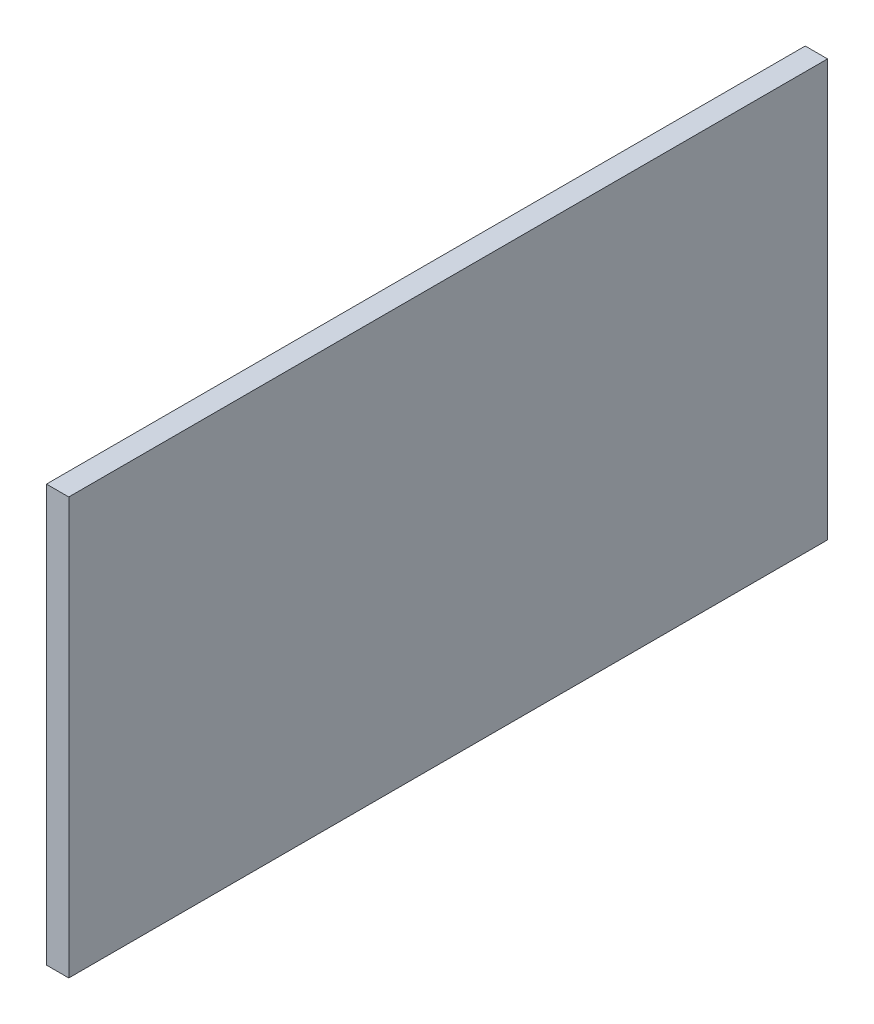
ISO-10303-21;
HEADER;
FILE_DESCRIPTION(('STEP AP214'),'2;1');
FILE_NAME('part.step','',(''),(''),'','','');
FILE_SCHEMA(('AUTOMOTIVE_DESIGN { 1 0 10303 214 1 1 1 1 }'));
ENDSEC;
DATA;
#1=APPLICATION_CONTEXT('core data for automotive mechanical design processes');
#2=APPLICATION_PROTOCOL_DEFINITION('international standard','automotive_design',2000,#1);
#3=PRODUCT_CONTEXT('',#1,'mechanical');
#4=PRODUCT('Part','Part','',(#3));
#5=PRODUCT_RELATED_PRODUCT_CATEGORY('part','',(#4));
#6=PRODUCT_DEFINITION_FORMATION('','',#4);
#7=PRODUCT_DEFINITION_CONTEXT('part definition',#1,'design');
#8=PRODUCT_DEFINITION('design','',#6,#7);
#9=PRODUCT_DEFINITION_SHAPE('','',#8);
#10=(LENGTH_UNIT() NAMED_UNIT(*) SI_UNIT(.MILLI.,.METRE.));
#11=(NAMED_UNIT(*) PLANE_ANGLE_UNIT() SI_UNIT($,.RADIAN.));
#12=(NAMED_UNIT(*) SI_UNIT($,.STERADIAN.) SOLID_ANGLE_UNIT());
#13=UNCERTAINTY_MEASURE_WITH_UNIT(LENGTH_MEASURE(1.E-05),#10,'distance_accuracy_value','');
#14=(GEOMETRIC_REPRESENTATION_CONTEXT(3) GLOBAL_UNCERTAINTY_ASSIGNED_CONTEXT((#13)) GLOBAL_UNIT_ASSIGNED_CONTEXT((#10,
#11,#12)) REPRESENTATION_CONTEXT('',''));
#15=CARTESIAN_POINT('',(0.,0.,0.));
#16=DIRECTION('',(0.,0.,1.));
#17=DIRECTION('',(1.,0.,0.));
#18=AXIS2_PLACEMENT_3D('',#15,#16,#17);
#19=CARTESIAN_POINT('',(0.,0.,647.7));
#20=DIRECTION('',(1.,0.,0.));
#21=DIRECTION('',(0.,0.,-1.));
#22=AXIS2_PLACEMENT_3D('',#19,#20,#21);
#23=PLANE('',#22);
#24=DIRECTION('',(0.,-1.,0.));
#25=VECTOR('',#24,1.);
#26=CARTESIAN_POINT('',(0.,0.,0.));
#27=LINE('',#26,#25);
#28=CARTESIAN_POINT('',(0.,355.6,0.));
#29=VERTEX_POINT('',#28);
#30=CARTESIAN_POINT('',(0.,0.,0.));
#31=VERTEX_POINT('',#30);
#32=EDGE_CURVE('E95',#29,#31,#27,.T.);
#33=ORIENTED_EDGE('',*,*,#32,.T.);
#34=DIRECTION('',(0.,0.,-1.));
#35=VECTOR('',#34,1.);
#36=CARTESIAN_POINT('',(0.,0.,647.7));
#37=LINE('',#36,#35);
#38=CARTESIAN_POINT('',(0.,0.,647.7));
#39=VERTEX_POINT('',#38);
#40=EDGE_CURVE('E11',#39,#31,#37,.T.);
#41=ORIENTED_EDGE('',*,*,#40,.F.);
#42=DIRECTION('',(0.,-1.,0.));
#43=VECTOR('',#42,1.);
#44=CARTESIAN_POINT('',(0.,0.,647.7));
#45=LINE('',#44,#43);
#46=CARTESIAN_POINT('',(0.,355.6,647.7));
#47=VERTEX_POINT('',#46);
#48=EDGE_CURVE('E83',#47,#39,#45,.T.);
#49=ORIENTED_EDGE('',*,*,#48,.F.);
#50=DIRECTION('',(0.,0.,-1.));
#51=VECTOR('',#50,1.);
#52=CARTESIAN_POINT('',(0.,355.6,647.7));
#53=LINE('',#52,#51);
#54=EDGE_CURVE('E91',#47,#29,#53,.T.);
#55=ORIENTED_EDGE('',*,*,#54,.T.);
#56=EDGE_LOOP('',(#33,#41,#49,#55));
#57=FACE_BOUND('',#56,.T.);
#58=ADVANCED_FACE('F32',(#57),#23,.F.);
#59=CARTESIAN_POINT('',(0.,0.,647.7));
#60=DIRECTION('',(0.,1.,0.));
#61=DIRECTION('',(0.,0.,1.));
#62=AXIS2_PLACEMENT_3D('',#59,#60,#61);
#63=PLANE('',#62);
#64=DIRECTION('',(1.,0.,0.));
#65=VECTOR('',#64,1.);
#66=CARTESIAN_POINT('',(0.,0.,0.));
#67=LINE('',#66,#65);
#68=CARTESIAN_POINT('',(19.05,0.,0.));
#69=VERTEX_POINT('',#68);
#70=EDGE_CURVE('E87',#31,#69,#67,.T.);
#71=ORIENTED_EDGE('',*,*,#70,.T.);
#72=DIRECTION('',(0.,0.,-1.));
#73=VECTOR('',#72,1.);
#74=CARTESIAN_POINT('',(19.05,0.,647.7));
#75=LINE('',#74,#73);
#76=CARTESIAN_POINT('',(19.05,0.,647.7));
#77=VERTEX_POINT('',#76);
#78=EDGE_CURVE('E40',#77,#69,#75,.T.);
#79=ORIENTED_EDGE('',*,*,#78,.F.);
#80=DIRECTION('',(1.,0.,0.));
#81=VECTOR('',#80,1.);
#82=CARTESIAN_POINT('',(0.,0.,647.7));
#83=LINE('',#82,#81);
#84=EDGE_CURVE('E78',#39,#77,#83,.T.);
#85=ORIENTED_EDGE('',*,*,#84,.F.);
#86=ORIENTED_EDGE('',*,*,#40,.T.);
#87=EDGE_LOOP('',(#71,#79,#85,#86));
#88=FACE_BOUND('',#87,.T.);
#89=ADVANCED_FACE('F86',(#88),#63,.F.);
#90=CARTESIAN_POINT('',(19.05,0.,647.7));
#91=DIRECTION('',(-1.,0.,0.));
#92=DIRECTION('',(0.,0.,1.));
#93=AXIS2_PLACEMENT_3D('',#90,#91,#92);
#94=PLANE('',#93);
#95=DIRECTION('',(0.,1.,0.));
#96=VECTOR('',#95,1.);
#97=CARTESIAN_POINT('',(19.05,0.,0.));
#98=LINE('',#97,#96);
#99=CARTESIAN_POINT('',(19.05,355.6,0.));
#100=VERTEX_POINT('',#99);
#101=EDGE_CURVE('E65',#69,#100,#98,.T.);
#102=ORIENTED_EDGE('',*,*,#101,.T.);
#103=DIRECTION('',(0.,0.,-1.));
#104=VECTOR('',#103,1.);
#105=CARTESIAN_POINT('',(19.05,355.6,647.7));
#106=LINE('',#105,#104);
#107=CARTESIAN_POINT('',(19.05,355.6,647.7));
#108=VERTEX_POINT('',#107);
#109=EDGE_CURVE('E88',#108,#100,#106,.T.);
#110=ORIENTED_EDGE('',*,*,#109,.F.);
#111=DIRECTION('',(0.,1.,0.));
#112=VECTOR('',#111,1.);
#113=CARTESIAN_POINT('',(19.05,0.,647.7));
#114=LINE('',#113,#112);
#115=EDGE_CURVE('E81',#77,#108,#114,.T.);
#116=ORIENTED_EDGE('',*,*,#115,.F.);
#117=ORIENTED_EDGE('',*,*,#78,.T.);
#118=EDGE_LOOP('',(#102,#110,#116,#117));
#119=FACE_BOUND('',#118,.T.);
#120=ADVANCED_FACE('F89',(#119),#94,.F.);
#121=CARTESIAN_POINT('',(0.,355.6,647.7));
#122=DIRECTION('',(0.,-1.,0.));
#123=DIRECTION('',(0.,0.,-1.));
#124=AXIS2_PLACEMENT_3D('',#121,#122,#123);
#125=PLANE('',#124);
#126=DIRECTION('',(-1.,0.,0.));
#127=VECTOR('',#126,1.);
#128=CARTESIAN_POINT('',(0.,355.6,0.));
#129=LINE('',#128,#127);
#130=EDGE_CURVE('E71',#100,#29,#129,.T.);
#131=ORIENTED_EDGE('',*,*,#130,.T.);
#132=ORIENTED_EDGE('',*,*,#54,.F.);
#133=DIRECTION('',(-1.,0.,0.));
#134=VECTOR('',#133,1.);
#135=CARTESIAN_POINT('',(0.,355.6,647.7));
#136=LINE('',#135,#134);
#137=EDGE_CURVE('E48',#108,#47,#136,.T.);
#138=ORIENTED_EDGE('',*,*,#137,.F.);
#139=ORIENTED_EDGE('',*,*,#109,.T.);
#140=EDGE_LOOP('',(#131,#132,#138,#139));
#141=FACE_BOUND('',#140,.T.);
#142=ADVANCED_FACE('F102',(#141),#125,.F.);
#143=CARTESIAN_POINT('',(0.,355.6,647.7));
#144=DIRECTION('',(0.,0.,-1.));
#145=DIRECTION('',(-1.,0.,0.));
#146=AXIS2_PLACEMENT_3D('',#143,#144,#145);
#147=PLANE('',#146);
#148=ORIENTED_EDGE('',*,*,#48,.T.);
#149=ORIENTED_EDGE('',*,*,#84,.T.);
#150=ORIENTED_EDGE('',*,*,#115,.T.);
#151=ORIENTED_EDGE('',*,*,#137,.T.);
#152=EDGE_LOOP('',(#148,#149,#150,#151));
#153=FACE_BOUND('',#152,.T.);
#154=ADVANCED_FACE('F79',(#153),#147,.F.);
#155=CARTESIAN_POINT('',(0.,355.6,0.));
#156=DIRECTION('',(0.,0.,-1.));
#157=DIRECTION('',(-1.,0.,0.));
#158=AXIS2_PLACEMENT_3D('',#155,#156,#157);
#159=PLANE('',#158);
#160=ORIENTED_EDGE('',*,*,#32,.F.);
#161=ORIENTED_EDGE('',*,*,#130,.F.);
#162=ORIENTED_EDGE('',*,*,#101,.F.);
#163=ORIENTED_EDGE('',*,*,#70,.F.);
#164=EDGE_LOOP('',(#160,#161,#162,#163));
#165=FACE_BOUND('',#164,.T.);
#166=ADVANCED_FACE('F105',(#165),#159,.T.);
#167=CLOSED_SHELL('',(#58,#89,#120,#142,#154,#166));
#168=MANIFOLD_SOLID_BREP('B2',#167);
#169=ADVANCED_BREP_SHAPE_REPRESENTATION('',(#18,#168),#14);
#170=SHAPE_DEFINITION_REPRESENTATION(#9,#169);
ENDSEC;
END-ISO-10303-21;
